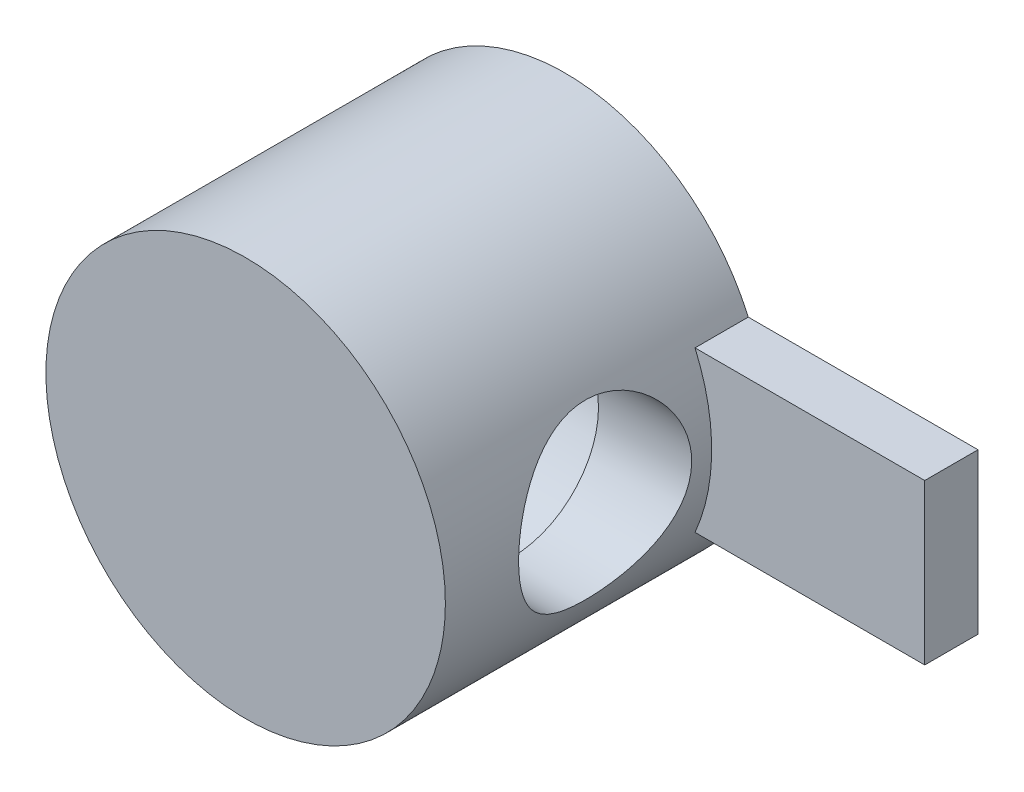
ISO-10303-21;
HEADER;
FILE_DESCRIPTION(('STEP AP214'),'2;1');
FILE_NAME('part.step','',(''),(''),'','','');
FILE_SCHEMA(('AUTOMOTIVE_DESIGN { 1 0 10303 214 1 1 1 1 }'));
ENDSEC;
DATA;
#1=APPLICATION_CONTEXT('core data for automotive mechanical design processes');
#2=APPLICATION_PROTOCOL_DEFINITION('international standard','automotive_design',2000,#1);
#3=PRODUCT_CONTEXT('',#1,'mechanical');
#4=PRODUCT('Part','Part','',(#3));
#5=PRODUCT_RELATED_PRODUCT_CATEGORY('part','',(#4));
#6=PRODUCT_DEFINITION_FORMATION('','',#4);
#7=PRODUCT_DEFINITION_CONTEXT('part definition',#1,'design');
#8=PRODUCT_DEFINITION('design','',#6,#7);
#9=PRODUCT_DEFINITION_SHAPE('','',#8);
#10=(LENGTH_UNIT() NAMED_UNIT(*) SI_UNIT(.MILLI.,.METRE.));
#11=(NAMED_UNIT(*) PLANE_ANGLE_UNIT() SI_UNIT($,.RADIAN.));
#12=(NAMED_UNIT(*) SI_UNIT($,.STERADIAN.) SOLID_ANGLE_UNIT());
#13=UNCERTAINTY_MEASURE_WITH_UNIT(LENGTH_MEASURE(1.E-05),#10,'distance_accuracy_value','');
#14=(GEOMETRIC_REPRESENTATION_CONTEXT(3) GLOBAL_UNCERTAINTY_ASSIGNED_CONTEXT((#13)) GLOBAL_UNIT_ASSIGNED_CONTEXT((#10,
#11,#12)) REPRESENTATION_CONTEXT('',''));
#15=CARTESIAN_POINT('',(0.,0.,0.));
#16=DIRECTION('',(0.,0.,1.));
#17=DIRECTION('',(1.,0.,0.));
#18=AXIS2_PLACEMENT_3D('',#15,#16,#17);
#19=CARTESIAN_POINT('',(0.,0.,6.));
#20=DIRECTION('',(0.,0.,-1.));
#21=DIRECTION('',(-1.,0.,0.));
#22=AXIS2_PLACEMENT_3D('',#19,#20,#21);
#23=CYLINDRICAL_SURFACE('',#22,7.5);
#24=CARTESIAN_POINT('',(-7.5,0.,5.));
#25=CARTESIAN_POINT('',(-7.49999996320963,-0.125608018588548,4.99999996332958));
#26=CARTESIAN_POINT('',(-7.49683780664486,-0.251216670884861,4.99526045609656));
#27=CARTESIAN_POINT('',(-7.48426887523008,-0.501407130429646,4.97637719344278));
#28=CARTESIAN_POINT('',(-7.47486206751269,-0.625988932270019,4.96223338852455));
#29=CARTESIAN_POINT('',(-7.45003382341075,-0.873171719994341,4.92475388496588));
#30=CARTESIAN_POINT('',(-7.43461128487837,-0.99577233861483,4.90141650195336));
#31=CARTESIAN_POINT('',(-7.39811136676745,-1.23813427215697,4.84587344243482));
#32=CARTESIAN_POINT('',(-7.37703158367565,-1.35789435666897,4.8136639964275));
#33=CARTESIAN_POINT('',(-7.32981525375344,-1.59314893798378,4.74098638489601));
#34=CARTESIAN_POINT('',(-7.30370546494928,-1.70866231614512,4.70056186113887));
#35=CARTESIAN_POINT('',(-7.24690654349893,-1.93546860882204,4.61181215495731));
#36=CARTESIAN_POINT('',(-7.21621562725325,-2.04675985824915,4.56348389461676));
#37=CARTESIAN_POINT('',(-7.11817827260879,-2.37341381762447,4.40738741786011));
#38=CARTESIAN_POINT('',(-7.04482484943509,-2.58175996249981,4.28844372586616));
#39=CARTESIAN_POINT('',(-6.88067945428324,-2.99324442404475,4.01334849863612));
#40=CARTESIAN_POINT('',(-6.78893589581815,-3.19444057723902,3.85489609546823));
#41=CARTESIAN_POINT('',(-6.59954434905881,-3.56933031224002,3.51065910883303));
#42=CARTESIAN_POINT('',(-6.5018880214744,-3.74298373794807,3.32483536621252));
#43=CARTESIAN_POINT('',(-6.34919628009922,-3.99366214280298,3.01202024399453));
#44=CARTESIAN_POINT('',(-6.29351311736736,-4.08060552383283,2.89316385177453));
#45=CARTESIAN_POINT('',(-6.18443450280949,-4.24410607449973,2.6475199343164));
#46=CARTESIAN_POINT('',(-6.13103957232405,-4.32066088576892,2.52073061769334));
#47=CARTESIAN_POINT('',(-5.97715554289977,-4.53366662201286,2.12929062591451));
#48=CARTESIAN_POINT('',(-5.88264084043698,-4.65396866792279,1.85293596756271));
#49=CARTESIAN_POINT('',(-5.74940066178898,-4.81686735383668,1.3581492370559));
#50=CARTESIAN_POINT('',(-5.70244638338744,-4.87187088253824,1.1460313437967));
#51=CARTESIAN_POINT('',(-5.64915905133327,-4.93332515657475,0.821257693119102));
#52=CARTESIAN_POINT('',(-5.63425589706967,-4.95029943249,0.711934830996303));
#53=CARTESIAN_POINT('',(-5.61069296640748,-4.97699249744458,0.491757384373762));
#54=CARTESIAN_POINT('',(-5.6020309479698,-4.98671389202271,0.38090336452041));
#55=CARTESIAN_POINT('',(-5.59128886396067,-4.99875512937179,0.157992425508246));
#56=CARTESIAN_POINT('',(-5.58923742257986,-5.00104278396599,0.0459323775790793));
#57=CARTESIAN_POINT('',(-5.5918825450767,-4.9980849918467,-0.17800706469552));
#58=CARTESIAN_POINT('',(-5.59657913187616,-4.99283951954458,-0.289886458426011));
#59=CARTESIAN_POINT('',(-5.61252620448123,-4.97490634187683,-0.512636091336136));
#60=CARTESIAN_POINT('',(-5.62378029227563,-4.96221454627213,-0.623505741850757));
#61=CARTESIAN_POINT('',(-5.65238050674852,-4.92961024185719,-0.843396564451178));
#62=CARTESIAN_POINT('',(-5.66972910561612,-4.90969480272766,-0.952416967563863));
#63=CARTESIAN_POINT('',(-5.72818076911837,-4.84163703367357,-1.26603456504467));
#64=CARTESIAN_POINT('',(-5.77653702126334,-4.78429713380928,-1.46736629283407));
#65=CARTESIAN_POINT('',(-5.88774075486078,-4.64674861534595,-1.85759628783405));
#66=CARTESIAN_POINT('',(-5.95059300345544,-4.56653247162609,-2.0464904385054));
#67=CARTESIAN_POINT('',(-6.09910267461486,-4.36685173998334,-2.44754530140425));
#68=CARTESIAN_POINT('',(-6.18679835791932,-4.24272264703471,-2.65662327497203));
#69=CARTESIAN_POINT('',(-6.36729804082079,-3.96670264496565,-3.05348499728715));
#70=CARTESIAN_POINT('',(-6.46010824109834,-3.81477749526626,-3.24124201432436));
#71=CARTESIAN_POINT('',(-6.60779163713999,-3.54969108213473,-3.52437255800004));
#72=CARTESIAN_POINT('',(-6.66328847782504,-3.44464766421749,-3.62713083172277));
#73=CARTESIAN_POINT('',(-6.77217054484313,-3.22531791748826,-3.82347713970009));
#74=CARTESIAN_POINT('',(-6.82555639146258,-3.11103433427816,-3.9170678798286));
#75=CARTESIAN_POINT('',(-6.92883688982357,-2.87366828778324,-4.09438233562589));
#76=CARTESIAN_POINT('',(-6.97873321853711,-2.75059010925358,-4.17811080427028));
#77=CARTESIAN_POINT('',(-7.07374288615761,-2.49611507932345,-4.33494297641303));
#78=CARTESIAN_POINT('',(-7.11885767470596,-2.36472076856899,-4.40804990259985));
#79=CARTESIAN_POINT('',(-7.1947926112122,-2.12083178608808,-4.52955003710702));
#80=CARTESIAN_POINT('',(-7.22668145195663,-2.00967972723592,-4.57997874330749));
#81=CARTESIAN_POINT('',(-7.2859316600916,-1.78295269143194,-4.67290941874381));
#82=CARTESIAN_POINT('',(-7.31329394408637,-1.66737861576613,-4.71541299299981));
#83=CARTESIAN_POINT('',(-7.36291212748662,-1.43245611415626,-4.79200645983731));
#84=CARTESIAN_POINT('',(-7.38517017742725,-1.31310930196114,-4.82609989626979));
#85=CARTESIAN_POINT('',(-7.42408961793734,-1.07138735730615,-4.88544867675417));
#86=CARTESIAN_POINT('',(-7.44075325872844,-0.949013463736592,-4.91070757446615));
#87=CARTESIAN_POINT('',(-7.4681644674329,-0.70149328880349,-4.95214332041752));
#88=CARTESIAN_POINT('',(-7.4788845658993,-0.57633687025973,-4.96827800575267));
#89=CARTESIAN_POINT('',(-7.4940239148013,-0.32478000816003,-4.9910386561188));
#90=CARTESIAN_POINT('',(-7.49844315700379,-0.198379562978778,-4.99766460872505));
#91=CARTESIAN_POINT('',(-7.50086789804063,0.0546163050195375,-5.00130194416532));
#92=CARTESIAN_POINT('',(-7.49887366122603,0.181211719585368,-4.99831372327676));
#93=CARTESIAN_POINT('',(-7.48852351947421,0.433544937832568,-4.98277210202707));
#94=CARTESIAN_POINT('',(-7.48016788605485,0.559282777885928,-4.97021910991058));
#95=CARTESIAN_POINT('',(-7.45811180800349,0.800084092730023,-4.93696015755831));
#96=CARTESIAN_POINT('',(-7.44483013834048,0.915274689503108,-4.91689203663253));
#97=CARTESIAN_POINT('',(-7.41323727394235,1.14332502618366,-4.86892255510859));
#98=CARTESIAN_POINT('',(-7.39492437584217,1.25618396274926,-4.84101854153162));
#99=CARTESIAN_POINT('',(-7.33297199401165,1.59016819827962,-4.74603269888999));
#100=CARTESIAN_POINT('',(-7.28229985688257,1.80689828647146,-4.66764915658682));
#101=CARTESIAN_POINT('',(-7.16240567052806,2.23669773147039,-4.47836285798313));
#102=CARTESIAN_POINT('',(-7.09224590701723,2.44875011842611,-4.36577789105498));
#103=CARTESIAN_POINT('',(-6.94004723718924,2.8516978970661,-4.11391849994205));
#104=CARTESIAN_POINT('',(-6.85800100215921,3.0425801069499,-3.97462759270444));
#105=CARTESIAN_POINT('',(-6.67386338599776,3.42963933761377,-3.64847975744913));
#106=CARTESIAN_POINT('',(-6.57065384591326,3.62188054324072,-3.45758419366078));
#107=CARTESIAN_POINT('',(-6.36427940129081,3.97334834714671,-3.04722158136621));
#108=CARTESIAN_POINT('',(-6.26111457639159,4.13255212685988,-2.82773495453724));
#109=CARTESIAN_POINT('',(-6.07349195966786,4.40311961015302,-2.38214392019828));
#110=CARTESIAN_POINT('',(-5.98818993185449,4.51739093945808,-2.15816986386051));
#111=CARTESIAN_POINT('',(-5.83597435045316,4.71240530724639,-1.69031842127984));
#112=CARTESIAN_POINT('',(-5.76902777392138,4.79320869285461,-1.44647781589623));
#113=CARTESIAN_POINT('',(-5.67333023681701,4.90589604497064,-0.988588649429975));
#114=CARTESIAN_POINT('',(-5.63987506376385,4.94396476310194,-0.777070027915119));
#115=CARTESIAN_POINT('',(-5.59698654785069,4.99248032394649,-0.348567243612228));
#116=CARTESIAN_POINT('',(-5.58752711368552,5.00295716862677,-0.131589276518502));
#117=CARTESIAN_POINT('',(-5.59410544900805,4.99559738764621,0.301609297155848));
#118=CARTESIAN_POINT('',(-5.61015831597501,4.97774399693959,0.51782937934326));
#119=CARTESIAN_POINT('',(-5.66525973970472,4.91492740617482,0.943352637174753));
#120=CARTESIAN_POINT('',(-5.7043389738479,4.8699280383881,1.15264619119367));
#121=CARTESIAN_POINT('',(-5.81317852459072,4.73981418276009,1.61430721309));
#122=CARTESIAN_POINT('',(-5.88833948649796,4.64720557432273,1.86329193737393));
#123=CARTESIAN_POINT('',(-6.0137282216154,4.48217153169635,2.2197721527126));
#124=CARTESIAN_POINT('',(-6.05768608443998,4.4227291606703,2.33588098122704));
#125=CARTESIAN_POINT('',(-6.14853438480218,4.29553797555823,2.5622633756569));
#126=CARTESIAN_POINT('',(-6.19542487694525,4.22778900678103,2.67253683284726));
#127=CARTESIAN_POINT('',(-6.3403823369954,4.0100125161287,2.99813157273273));
#128=CARTESIAN_POINT('',(-6.44119239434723,3.84739387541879,3.20406498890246));
#129=CARTESIAN_POINT('',(-6.5908294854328,3.58070368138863,3.49223623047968));
#130=CARTESIAN_POINT('',(-6.64046727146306,3.48796686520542,3.5848751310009));
#131=CARTESIAN_POINT('',(-6.73828470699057,3.29502624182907,3.76298200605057));
#132=CARTESIAN_POINT('',(-6.78646402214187,3.1948207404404,3.84844834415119));
#133=CARTESIAN_POINT('',(-6.88712610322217,2.97228582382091,4.02347385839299));
#134=CARTESIAN_POINT('',(-6.93922872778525,2.84884898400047,4.11184847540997));
#135=CARTESIAN_POINT('',(-7.03877400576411,2.59315796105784,4.27770219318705));
#136=CARTESIAN_POINT('',(-7.08621876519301,2.46090780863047,4.35518622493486));
#137=CARTESIAN_POINT('',(-7.17506685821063,2.18836443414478,4.49830278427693));
#138=CARTESIAN_POINT('',(-7.21647581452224,2.04807886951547,4.5639463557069));
#139=CARTESIAN_POINT('',(-7.29200187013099,1.76034275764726,4.68245428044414));
#140=CARTESIAN_POINT('',(-7.32612152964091,1.61289474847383,4.73532312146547));
#141=CARTESIAN_POINT('',(-7.37927647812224,1.34555428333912,4.81710032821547));
#142=CARTESIAN_POINT('',(-7.39997893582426,1.22681585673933,4.84872238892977));
#143=CARTESIAN_POINT('',(-7.43582405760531,0.986541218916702,4.90325435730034));
#144=CARTESIAN_POINT('',(-7.45096786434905,0.865005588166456,4.9261660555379));
#145=CARTESIAN_POINT('',(-7.47533722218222,0.620058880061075,4.96294834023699));
#146=CARTESIAN_POINT('',(-7.48456629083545,0.496648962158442,4.97682430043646));
#147=CARTESIAN_POINT('',(-7.49689781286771,0.248826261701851,4.99535032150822));
#148=CARTESIAN_POINT('',(-7.50000003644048,0.12441344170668,5.00000003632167));
#149=CARTESIAN_POINT('',(-7.5,0.,5.));
#150=B_SPLINE_CURVE_WITH_KNOTS('',3,(#24,#25,#26,#27,#28,#29,#30,#31,#32,#33,#34,#35,#36,#37,
#38,#39,#40,#41,#42,#43,#44,#45,#46,#47,#48,#49,#50,#51,#52,#53,#54,#55,#56,#57,#58,#59,#60,#61,
#62,#63,#64,#65,#66,#67,#68,#69,#70,#71,#72,#73,#74,#75,#76,#77,#78,#79,#80,#81,#82,#83,#84,#85,
#86,#87,#88,#89,#90,#91,#92,#93,#94,#95,#96,#97,#98,#99,#100,#101,#102,#103,#104,#105,#106,#107,
#108,#109,#110,#111,#112,#113,#114,#115,#116,#117,#118,#119,#120,#121,#122,#123,#124,#125,#126,
#127,#128,#129,#130,#131,#132,#133,#134,#135,#136,#137,#138,#139,#140,#141,#142,#143,#144,#145,
#146,#147,#148,#149),.UNSPECIFIED.,.T.,.F.,(4,2,2,2,2,2,2,2,2,2,2,2,2,2,2,2,2,2,2,2,2,2,2,2,2,2,
2,2,2,2,2,2,2,2,2,2,2,2,2,2,2,2,2,2,2,2,2,2,2,2,2,2,2,2,2,2,2,2,2,2,2,2,4),(0.,
0.376697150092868,0.7533962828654,1.13016446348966,1.5070929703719,1.88206910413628,
2.2571916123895,3.00679232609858,3.82000195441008,4.63438651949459,5.10618372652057,
5.57808786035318,6.5193034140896,7.18876311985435,7.52328813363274,7.85769291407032,
8.19354375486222,8.52939573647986,8.86543237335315,9.20160547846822,9.84356710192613,
10.4857401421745,11.2585349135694,12.032288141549,12.5030398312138,12.9736521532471,
13.44403673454,13.9142782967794,14.2923626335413,14.6703703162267,15.0482184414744,
15.4259144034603,15.8053417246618,16.184769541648,16.5641817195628,16.9435777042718,
17.2962009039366,17.6489436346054,18.3538353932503,19.1014251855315,19.8494778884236,
20.7158209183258,21.5827603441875,22.3763648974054,23.1685321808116,23.8182177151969,
24.4671965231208,25.1165595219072,25.7667896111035,26.5902817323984,27.0029102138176,
27.4155463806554,28.2552096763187,28.6754157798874,29.0957174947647,29.5765774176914,
30.0572189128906,30.5374097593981,31.0174316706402,31.3908313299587,31.7641541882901,
32.1372548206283,32.5103694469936),.UNSPECIFIED.);
#151=CARTESIAN_POINT('',(-7.5,0.,5.));
#152=VERTEX_POINT('',#151);
#153=EDGE_CURVE('E115',#152,#152,#150,.T.);
#154=ORIENTED_EDGE('',*,*,#153,.T.);
#155=EDGE_LOOP('',(#154));
#156=FACE_BOUND('',#155,.T.);
#157=CARTESIAN_POINT('',(7.5,0.,-3.25));
#158=CARTESIAN_POINT('',(7.49999920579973,-0.0867763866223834,-3.24999894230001));
#159=CARTESIAN_POINT('',(7.49848837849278,-0.173581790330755,-3.2465175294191));
#160=CARTESIAN_POINT('',(7.49249105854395,-0.346548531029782,-3.23263862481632));
#161=CARTESIAN_POINT('',(7.48800279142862,-0.432709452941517,-3.22223700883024));
#162=CARTESIAN_POINT('',(7.47019636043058,-0.689578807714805,-3.18072633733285));
#163=CARTESIAN_POINT('',(7.45253695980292,-0.858454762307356,-3.1393117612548));
#164=CARTESIAN_POINT('',(7.40753995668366,-1.18558869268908,-3.03093022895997));
#165=CARTESIAN_POINT('',(7.38023622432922,-1.34388155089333,-2.96405263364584));
#166=CARTESIAN_POINT('',(7.31858626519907,-1.6468737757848,-2.80702894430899));
#167=CARTESIAN_POINT('',(7.28424185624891,-1.79157663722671,-2.71688885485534));
#168=CARTESIAN_POINT('',(7.20986004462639,-2.07120208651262,-2.51082671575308));
#169=CARTESIAN_POINT('',(7.16962655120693,-2.20530216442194,-2.39386072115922));
#170=CARTESIAN_POINT('',(7.08880906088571,-2.45270319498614,-2.13967940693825));
#171=CARTESIAN_POINT('',(7.04822487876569,-2.56599235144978,-2.00245268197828));
#172=CARTESIAN_POINT('',(6.96882482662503,-2.77464004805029,-1.70264337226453));
#173=CARTESIAN_POINT('',(6.93022412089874,-2.86869345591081,-1.53908945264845));
#174=CARTESIAN_POINT('',(6.86230522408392,-3.02758793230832,-1.19657606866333));
#175=CARTESIAN_POINT('',(6.83298187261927,-3.09244524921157,-1.01762523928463));
#176=CARTESIAN_POINT('',(6.78907760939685,-3.18764229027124,-0.65885789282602));
#177=CARTESIAN_POINT('',(6.77382250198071,-3.21957039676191,-0.479548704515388));
#178=CARTESIAN_POINT('',(6.7578621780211,-3.25294918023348,-0.117519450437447));
#179=CARTESIAN_POINT('',(6.75714796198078,-3.25441870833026,0.0651984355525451));
#180=CARTESIAN_POINT('',(6.76978434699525,-3.22802785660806,0.412413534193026));
#181=CARTESIAN_POINT('',(6.78195573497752,-3.20262667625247,0.577149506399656));
#182=CARTESIAN_POINT('',(6.81698519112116,-3.12736587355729,0.899737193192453));
#183=CARTESIAN_POINT('',(6.83984550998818,-3.07750109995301,1.05758745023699));
#184=CARTESIAN_POINT('',(6.89420310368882,-2.95374333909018,1.36606771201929));
#185=CARTESIAN_POINT('',(6.92587953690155,-2.87934526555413,1.51646208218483));
#186=CARTESIAN_POINT('',(6.99426673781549,-2.7089932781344,1.8032475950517));
#187=CARTESIAN_POINT('',(7.03097957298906,-2.6130305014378,1.93963294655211));
#188=CARTESIAN_POINT('',(7.10941239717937,-2.39190875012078,2.2077536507));
#189=CARTESIAN_POINT('',(7.15128210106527,-2.26487460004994,2.33790334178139));
#190=CARTESIAN_POINT('',(7.23247958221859,-1.99040445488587,2.5756086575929));
#191=CARTESIAN_POINT('',(7.2718066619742,-1.8429628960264,2.68315810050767));
#192=CARTESIAN_POINT('',(7.34480480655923,-1.52670852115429,2.87519931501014));
#193=CARTESIAN_POINT('',(7.37829595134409,-1.35742869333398,2.95899555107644));
#194=CARTESIAN_POINT('',(7.43444419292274,-1.00535134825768,3.09635501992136));
#195=CARTESIAN_POINT('',(7.45710777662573,-0.822562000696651,3.14993635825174));
#196=CARTESIAN_POINT('',(7.48780482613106,-0.461861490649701,3.22190944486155));
#197=CARTESIAN_POINT('',(7.49671995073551,-0.284449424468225,3.24242604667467));
#198=CARTESIAN_POINT('',(7.50176831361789,0.0714944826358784,3.25408457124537));
#199=CARTESIAN_POINT('',(7.49790561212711,0.250025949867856,3.24523582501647));
#200=CARTESIAN_POINT('',(7.47839698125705,0.592854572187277,3.1998897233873));
#201=CARTESIAN_POINT('',(7.46340609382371,0.757396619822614,3.16492874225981));
#202=CARTESIAN_POINT('',(7.42387219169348,1.07807205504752,3.07053874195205));
#203=CARTESIAN_POINT('',(7.39932799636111,1.23420440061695,3.01110669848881));
#204=CARTESIAN_POINT('',(7.34205931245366,1.53915532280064,2.86754139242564));
#205=CARTESIAN_POINT('',(7.30910316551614,1.68759288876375,2.7826942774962));
#206=CARTESIAN_POINT('',(7.23846784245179,1.96865898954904,2.59148679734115));
#207=CARTESIAN_POINT('',(7.20078663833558,2.1012806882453,2.48511718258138));
#208=CARTESIAN_POINT('',(7.12114143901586,2.35769628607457,2.24433239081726));
#209=CARTESIAN_POINT('',(7.0790709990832,2.48002570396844,2.10838899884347));
#210=CARTESIAN_POINT('',(6.99790250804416,2.70059365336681,1.81731897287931));
#211=CARTESIAN_POINT('',(6.95880535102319,2.79882495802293,1.6621866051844));
#212=CARTESIAN_POINT('',(6.88752402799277,2.96998491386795,1.33295021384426));
#213=CARTESIAN_POINT('',(6.85548983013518,3.04238178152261,1.15853477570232));
#214=CARTESIAN_POINT('',(6.80388878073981,3.15611608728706,0.798152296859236));
#215=CARTESIAN_POINT('',(6.7843105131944,3.19748197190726,0.612196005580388));
#216=CARTESIAN_POINT('',(6.76167840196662,3.24504783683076,0.250386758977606));
#217=CARTESIAN_POINT('',(6.75740442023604,3.25384641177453,0.0749507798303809));
#218=CARTESIAN_POINT('',(6.762578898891,3.24307986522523,-0.274823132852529));
#219=CARTESIAN_POINT('',(6.77202479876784,3.2235200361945,-0.44916126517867));
#220=CARTESIAN_POINT('',(6.80242169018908,3.1588315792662,-0.78196569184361));
#221=CARTESIAN_POINT('',(6.82271862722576,3.11515227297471,-0.940779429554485));
#222=CARTESIAN_POINT('',(6.87196590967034,3.00494702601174,-1.24882888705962));
#223=CARTESIAN_POINT('',(6.90091872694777,2.93841455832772,-1.39806185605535));
#224=CARTESIAN_POINT('',(6.96646014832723,2.77961198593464,-1.69293748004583));
#225=CARTESIAN_POINT('',(7.00341347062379,2.68599066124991,-1.83776958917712));
#226=CARTESIAN_POINT('',(7.07986300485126,2.47746977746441,-2.11048018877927));
#227=CARTESIAN_POINT('',(7.11936020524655,2.36256191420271,-2.23835202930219));
#228=CARTESIAN_POINT('',(7.20030378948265,2.10368198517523,-2.48423852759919));
#229=CARTESIAN_POINT('',(7.24164702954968,1.95810523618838,-2.60060284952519));
#230=CARTESIAN_POINT('',(7.31846056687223,1.64789902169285,-2.80742204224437));
#231=CARTESIAN_POINT('',(7.35392819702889,1.48326096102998,-2.89786516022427));
#232=CARTESIAN_POINT('',(7.39951351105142,1.22665401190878,-3.0110541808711));
#233=CARTESIAN_POINT('',(7.41337498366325,1.1400882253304,-3.04489299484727));
#234=CARTESIAN_POINT('',(7.43831489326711,0.964028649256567,-3.10512263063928));
#235=CARTESIAN_POINT('',(7.44939466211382,0.874536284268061,-3.13151701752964));
#236=CARTESIAN_POINT('',(7.46841929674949,0.693528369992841,-3.17650749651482));
#237=CARTESIAN_POINT('',(7.4763717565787,0.602018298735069,-3.19512248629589));
#238=CARTESIAN_POINT('',(7.48893715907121,0.417554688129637,-3.22441573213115));
#239=CARTESIAN_POINT('',(7.49355247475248,0.324602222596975,-3.23509962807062));
#240=CARTESIAN_POINT('',(7.49761910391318,0.192858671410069,-3.24450247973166));
#241=CARTESIAN_POINT('',(7.49851130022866,0.154323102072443,-3.24656330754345));
#242=CARTESIAN_POINT('',(7.49970192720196,0.0771936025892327,-3.24931230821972));
#243=CARTESIAN_POINT('',(7.50000035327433,0.0385996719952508,-3.25000047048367));
#244=CARTESIAN_POINT('',(7.5,0.,-3.25));
#245=B_SPLINE_CURVE_WITH_KNOTS('',3,(#157,#158,#159,#160,#161,#162,#163,#164,#165,#166,#167,
#168,#169,#170,#171,#172,#173,#174,#175,#176,#177,#178,#179,#180,#181,#182,#183,#184,#185,#186,
#187,#188,#189,#190,#191,#192,#193,#194,#195,#196,#197,#198,#199,#200,#201,#202,#203,#204,#205,
#206,#207,#208,#209,#210,#211,#212,#213,#214,#215,#216,#217,#218,#219,#220,#221,#222,#223,#224,
#225,#226,#227,#228,#229,#230,#231,#232,#233,#234,#235,#236,#237,#238,#239,#240,#241,#242,#243,
#244),.UNSPECIFIED.,.T.,.F.,(4,2,2,2,2,2,2,2,2,2,2,2,2,2,2,2,2,2,2,2,2,2,2,2,2,2,2,2,2,2,2,2,2,
2,2,2,2,2,2,2,2,2,2,4),(0.,0.260287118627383,0.520729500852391,1.04226269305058,1.5619822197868,
2.0815677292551,2.62652273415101,3.17178568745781,3.74661073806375,4.32111548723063,
4.86638885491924,5.41132473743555,5.91037627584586,6.40953294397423,6.91968477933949,
7.43004666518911,7.98742179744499,8.54494918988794,9.11742496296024,9.68955732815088,
10.2231999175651,10.7566729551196,11.2610112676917,11.7654119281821,12.2855745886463,
12.8059612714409,13.3663897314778,13.9269860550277,14.4985338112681,15.0695569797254,
15.5938943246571,16.1181338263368,16.6138453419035,17.1096985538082,17.6366140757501,
18.1637355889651,18.7337766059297,19.304075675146,19.5856794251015,19.8671480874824,
20.1479289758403,20.4285100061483,20.5442894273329,20.6600697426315),.UNSPECIFIED.);
#246=CARTESIAN_POINT('',(7.5,0.,-3.25));
#247=VERTEX_POINT('',#246);
#248=EDGE_CURVE('E103',#247,#247,#245,.T.);
#249=ORIENTED_EDGE('',*,*,#248,.T.);
#250=EDGE_LOOP('',(#249));
#251=FACE_BOUND('',#250,.T.);
#252=CARTESIAN_POINT('',(0.,0.,-6.));
#253=DIRECTION('',(0.,0.,1.));
#254=DIRECTION('',(1.,0.,0.));
#255=AXIS2_PLACEMENT_3D('',#252,#253,#254);
#256=CIRCLE('',#255,7.5);
#257=CARTESIAN_POINT('',(6.87386354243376,3.,-6.));
#258=VERTEX_POINT('',#257);
#259=CARTESIAN_POINT('',(6.87386354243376,-3.,-6.));
#260=VERTEX_POINT('',#259);
#261=EDGE_CURVE('E40',#258,#260,#256,.T.);
#262=ORIENTED_EDGE('',*,*,#261,.T.);
#263=DIRECTION('',(0.,0.,-1.));
#264=VECTOR('',#263,1.);
#265=CARTESIAN_POINT('',(6.87386354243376,-3.,-4.));
#266=LINE('',#265,#264);
#267=CARTESIAN_POINT('',(6.87386354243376,-3.,-4.));
#268=VERTEX_POINT('',#267);
#269=EDGE_CURVE('E48',#268,#260,#266,.T.);
#270=ORIENTED_EDGE('',*,*,#269,.F.);
#271=CARTESIAN_POINT('',(-6.18116668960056E-11,0.,-4.));
#272=DIRECTION('',(0.,0.,1.));
#273=DIRECTION('',(-1.,0.,0.));
#274=AXIS2_PLACEMENT_3D('',#271,#272,#273);
#275=CIRCLE('',#274,7.50000000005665);
#276=CARTESIAN_POINT('',(6.87386354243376,3.,-4.));
#277=VERTEX_POINT('',#276);
#278=EDGE_CURVE('E52',#268,#277,#275,.T.);
#279=ORIENTED_EDGE('',*,*,#278,.T.);
#280=DIRECTION('',(0.,0.,-1.));
#281=VECTOR('',#280,1.);
#282=CARTESIAN_POINT('',(6.87386354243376,3.,-4.));
#283=LINE('',#282,#281);
#284=EDGE_CURVE('E85',#277,#258,#283,.T.);
#285=ORIENTED_EDGE('',*,*,#284,.T.);
#286=EDGE_LOOP('',(#262,#270,#279,#285));
#287=FACE_BOUND('',#286,.T.);
#288=CARTESIAN_POINT('',(0.,0.,6.));
#289=DIRECTION('',(0.,0.,1.));
#290=DIRECTION('',(1.,0.,0.));
#291=AXIS2_PLACEMENT_3D('',#288,#289,#290);
#292=CIRCLE('',#291,7.5);
#293=CARTESIAN_POINT('',(7.5,0.,6.));
#294=VERTEX_POINT('',#293);
#295=EDGE_CURVE('E11',#294,#294,#292,.T.);
#296=ORIENTED_EDGE('',*,*,#295,.F.);
#297=EDGE_LOOP('',(#296));
#298=FACE_BOUND('',#297,.T.);
#299=ADVANCED_FACE('F31',(#156,#251,#287,#298),#23,.T.);
#300=CARTESIAN_POINT('',(0.,0.,6.));
#301=DIRECTION('',(0.,0.,1.));
#302=DIRECTION('',(1.,0.,0.));
#303=AXIS2_PLACEMENT_3D('',#300,#301,#302);
#304=PLANE('',#303);
#305=ORIENTED_EDGE('',*,*,#295,.T.);
#306=EDGE_LOOP('',(#305));
#307=FACE_BOUND('',#306,.T.);
#308=ADVANCED_FACE('F138',(#307),#304,.T.);
#309=CARTESIAN_POINT('',(0.,0.,-6.));
#310=DIRECTION('',(0.,0.,1.));
#311=DIRECTION('',(1.,0.,0.));
#312=AXIS2_PLACEMENT_3D('',#309,#310,#311);
#313=PLANE('',#312);
#314=ORIENTED_EDGE('',*,*,#261,.F.);
#315=DIRECTION('',(1.,0.,0.));
#316=VECTOR('',#315,1.);
#317=CARTESIAN_POINT('',(6.87386354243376,3.,-6.));
#318=LINE('',#317,#316);
#319=CARTESIAN_POINT('',(15.5,3.,-6.));
#320=VERTEX_POINT('',#319);
#321=EDGE_CURVE('E101',#258,#320,#318,.T.);
#322=ORIENTED_EDGE('',*,*,#321,.T.);
#323=DIRECTION('',(0.,-1.,0.));
#324=VECTOR('',#323,1.);
#325=CARTESIAN_POINT('',(15.5,3.,-6.));
#326=LINE('',#325,#324);
#327=CARTESIAN_POINT('',(15.5,-3.,-6.));
#328=VERTEX_POINT('',#327);
#329=EDGE_CURVE('E79',#320,#328,#326,.T.);
#330=ORIENTED_EDGE('',*,*,#329,.T.);
#331=DIRECTION('',(-1.,0.,0.));
#332=VECTOR('',#331,1.);
#333=CARTESIAN_POINT('',(15.5,-3.,-6.));
#334=LINE('',#333,#332);
#335=EDGE_CURVE('E96',#328,#260,#334,.T.);
#336=ORIENTED_EDGE('',*,*,#335,.T.);
#337=EDGE_LOOP('',(#314,#322,#330,#336));
#338=FACE_BOUND('',#337,.T.);
#339=ADVANCED_FACE('F132',(#338),#313,.F.);
#340=CARTESIAN_POINT('',(15.5,-3.,-4.));
#341=DIRECTION('',(0.,-1.,0.));
#342=DIRECTION('',(0.,0.,-1.));
#343=AXIS2_PLACEMENT_3D('',#340,#341,#342);
#344=PLANE('',#343);
#345=ORIENTED_EDGE('',*,*,#335,.F.);
#346=DIRECTION('',(0.,0.,-1.));
#347=VECTOR('',#346,1.);
#348=CARTESIAN_POINT('',(15.5,-3.,-4.));
#349=LINE('',#348,#347);
#350=CARTESIAN_POINT('',(15.5,-3.,-4.));
#351=VERTEX_POINT('',#350);
#352=EDGE_CURVE('E84',#351,#328,#349,.T.);
#353=ORIENTED_EDGE('',*,*,#352,.F.);
#354=DIRECTION('',(-1.,0.,0.));
#355=VECTOR('',#354,1.);
#356=CARTESIAN_POINT('',(15.5,-3.,-4.));
#357=LINE('',#356,#355);
#358=EDGE_CURVE('E92',#351,#268,#357,.T.);
#359=ORIENTED_EDGE('',*,*,#358,.T.);
#360=ORIENTED_EDGE('',*,*,#269,.T.);
#361=EDGE_LOOP('',(#345,#353,#359,#360));
#362=FACE_BOUND('',#361,.T.);
#363=ADVANCED_FACE('F129',(#362),#344,.T.);
#364=CARTESIAN_POINT('',(15.5,3.,-4.));
#365=DIRECTION('',(1.,0.,0.));
#366=DIRECTION('',(0.,0.,-1.));
#367=AXIS2_PLACEMENT_3D('',#364,#365,#366);
#368=PLANE('',#367);
#369=ORIENTED_EDGE('',*,*,#329,.F.);
#370=DIRECTION('',(0.,0.,-1.));
#371=VECTOR('',#370,1.);
#372=CARTESIAN_POINT('',(15.5,3.,-4.));
#373=LINE('',#372,#371);
#374=CARTESIAN_POINT('',(15.5,3.,-4.));
#375=VERTEX_POINT('',#374);
#376=EDGE_CURVE('E73',#375,#320,#373,.T.);
#377=ORIENTED_EDGE('',*,*,#376,.F.);
#378=DIRECTION('',(0.,-1.,0.));
#379=VECTOR('',#378,1.);
#380=CARTESIAN_POINT('',(15.5,3.,-4.));
#381=LINE('',#380,#379);
#382=EDGE_CURVE('E76',#375,#351,#381,.T.);
#383=ORIENTED_EDGE('',*,*,#382,.T.);
#384=ORIENTED_EDGE('',*,*,#352,.T.);
#385=EDGE_LOOP('',(#369,#377,#383,#384));
#386=FACE_BOUND('',#385,.T.);
#387=ADVANCED_FACE('F75',(#386),#368,.T.);
#388=CARTESIAN_POINT('',(6.87386354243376,3.,-4.));
#389=DIRECTION('',(0.,1.,0.));
#390=DIRECTION('',(-1.,0.,0.));
#391=AXIS2_PLACEMENT_3D('',#388,#389,#390);
#392=PLANE('',#391);
#393=ORIENTED_EDGE('',*,*,#321,.F.);
#394=ORIENTED_EDGE('',*,*,#284,.F.);
#395=DIRECTION('',(1.,0.,0.));
#396=VECTOR('',#395,1.);
#397=CARTESIAN_POINT('',(6.87386354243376,3.,-4.));
#398=LINE('',#397,#396);
#399=EDGE_CURVE('E90',#277,#375,#398,.T.);
#400=ORIENTED_EDGE('',*,*,#399,.T.);
#401=ORIENTED_EDGE('',*,*,#376,.T.);
#402=EDGE_LOOP('',(#393,#394,#400,#401));
#403=FACE_BOUND('',#402,.T.);
#404=ADVANCED_FACE('F94',(#403),#392,.T.);
#405=CARTESIAN_POINT('',(-6.18116668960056E-11,0.,-4.));
#406=DIRECTION('',(0.,0.,-1.));
#407=DIRECTION('',(-1.,0.,0.));
#408=AXIS2_PLACEMENT_3D('',#405,#406,#407);
#409=PLANE('',#408);
#410=ORIENTED_EDGE('',*,*,#278,.F.);
#411=ORIENTED_EDGE('',*,*,#358,.F.);
#412=ORIENTED_EDGE('',*,*,#382,.F.);
#413=ORIENTED_EDGE('',*,*,#399,.F.);
#414=EDGE_LOOP('',(#410,#411,#412,#413));
#415=FACE_BOUND('',#414,.T.);
#416=ADVANCED_FACE('F89',(#415),#409,.F.);
#417=CARTESIAN_POINT('',(-10.,0.,0.));
#418=DIRECTION('',(1.,0.,0.));
#419=DIRECTION('',(0.,0.,-1.));
#420=AXIS2_PLACEMENT_3D('',#417,#418,#419);
#421=CYLINDRICAL_SURFACE('',#420,3.25);
#422=CARTESIAN_POINT('',(4.,0.,0.));
#423=DIRECTION('',(1.,0.,0.));
#424=DIRECTION('',(0.,0.,-1.));
#425=AXIS2_PLACEMENT_3D('',#422,#423,#424);
#426=CIRCLE('',#425,3.25);
#427=CARTESIAN_POINT('',(4.,0.,-3.25));
#428=VERTEX_POINT('',#427);
#429=EDGE_CURVE('E35',#428,#428,#426,.F.);
#430=ORIENTED_EDGE('',*,*,#429,.T.);
#431=EDGE_LOOP('',(#430));
#432=FACE_BOUND('',#431,.T.);
#433=ORIENTED_EDGE('',*,*,#248,.F.);
#434=EDGE_LOOP('',(#433));
#435=FACE_BOUND('',#434,.T.);
#436=ADVANCED_FACE('F119',(#432,#435),#421,.F.);
#437=CARTESIAN_POINT('',(-20.,0.,0.));
#438=DIRECTION('',(1.,0.,0.));
#439=DIRECTION('',(0.,0.,-1.));
#440=AXIS2_PLACEMENT_3D('',#437,#438,#439);
#441=CYLINDRICAL_SURFACE('',#440,5.);
#442=ORIENTED_EDGE('',*,*,#153,.F.);
#443=EDGE_LOOP('',(#442));
#444=FACE_BOUND('',#443,.T.);
#445=CARTESIAN_POINT('',(4.,0.,0.));
#446=DIRECTION('',(1.,0.,0.));
#447=DIRECTION('',(0.,0.,-1.));
#448=AXIS2_PLACEMENT_3D('',#445,#446,#447);
#449=CIRCLE('',#448,5.);
#450=CARTESIAN_POINT('',(4.,0.,-5.));
#451=VERTEX_POINT('',#450);
#452=EDGE_CURVE('E159',#451,#451,#449,.T.);
#453=ORIENTED_EDGE('',*,*,#452,.T.);
#454=EDGE_LOOP('',(#453));
#455=FACE_BOUND('',#454,.T.);
#456=ADVANCED_FACE('F123',(#444,#455),#441,.F.);
#457=CARTESIAN_POINT('',(4.,0.,0.));
#458=DIRECTION('',(1.,0.,0.));
#459=DIRECTION('',(0.,0.,-1.));
#460=AXIS2_PLACEMENT_3D('',#457,#458,#459);
#461=PLANE('',#460);
#462=ORIENTED_EDGE('',*,*,#452,.F.);
#463=EDGE_LOOP('',(#462));
#464=FACE_BOUND('',#463,.T.);
#465=ORIENTED_EDGE('',*,*,#429,.F.);
#466=EDGE_LOOP('',(#465));
#467=FACE_BOUND('',#466,.T.);
#468=ADVANCED_FACE('F165',(#464,#467),#461,.F.);
#469=CLOSED_SHELL('',(#299,#308,#339,#363,#387,#404,#416,#436,#456,#468));
#470=MANIFOLD_SOLID_BREP('B2',#469);
#471=ADVANCED_BREP_SHAPE_REPRESENTATION('',(#18,#470),#14);
#472=SHAPE_DEFINITION_REPRESENTATION(#9,#471);
ENDSEC;
END-ISO-10303-21;
